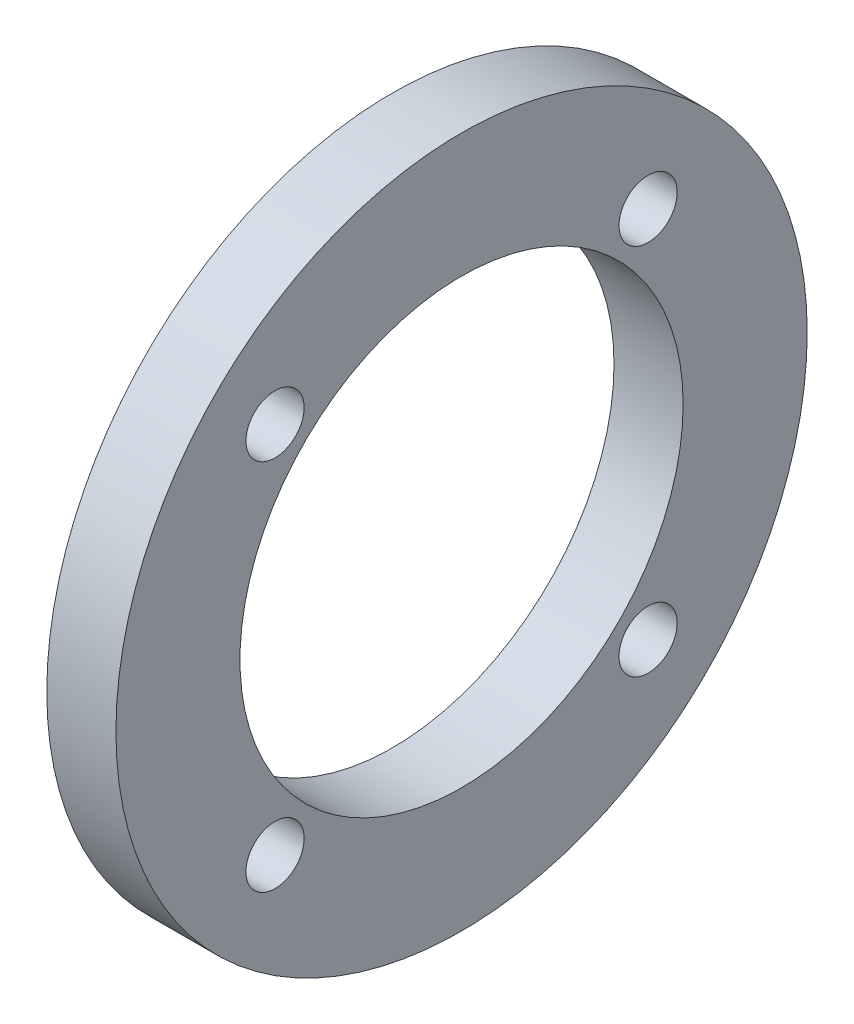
ISO-10303-21;
HEADER;
FILE_DESCRIPTION(('STEP AP214'),'2;1');
FILE_NAME('part.step','',(''),(''),'','','');
FILE_SCHEMA(('AUTOMOTIVE_DESIGN { 1 0 10303 214 1 1 1 1 }'));
ENDSEC;
DATA;
#1=APPLICATION_CONTEXT('core data for automotive mechanical design processes');
#2=APPLICATION_PROTOCOL_DEFINITION('international standard','automotive_design',2000,#1);
#3=PRODUCT_CONTEXT('',#1,'mechanical');
#4=PRODUCT('Part','Part','',(#3));
#5=PRODUCT_RELATED_PRODUCT_CATEGORY('part','',(#4));
#6=PRODUCT_DEFINITION_FORMATION('','',#4);
#7=PRODUCT_DEFINITION_CONTEXT('part definition',#1,'design');
#8=PRODUCT_DEFINITION('design','',#6,#7);
#9=PRODUCT_DEFINITION_SHAPE('','',#8);
#10=(LENGTH_UNIT() NAMED_UNIT(*) SI_UNIT(.MILLI.,.METRE.));
#11=(NAMED_UNIT(*) PLANE_ANGLE_UNIT() SI_UNIT($,.RADIAN.));
#12=(NAMED_UNIT(*) SI_UNIT($,.STERADIAN.) SOLID_ANGLE_UNIT());
#13=UNCERTAINTY_MEASURE_WITH_UNIT(LENGTH_MEASURE(1.E-05),#10,'distance_accuracy_value','');
#14=(GEOMETRIC_REPRESENTATION_CONTEXT(3) GLOBAL_UNCERTAINTY_ASSIGNED_CONTEXT((#13)) GLOBAL_UNIT_ASSIGNED_CONTEXT((#10,
#11,#12)) REPRESENTATION_CONTEXT('',''));
#15=CARTESIAN_POINT('',(0.,0.,0.));
#16=DIRECTION('',(0.,0.,1.));
#17=DIRECTION('',(1.,0.,0.));
#18=AXIS2_PLACEMENT_3D('',#15,#16,#17);
#19=CARTESIAN_POINT('',(0.,0.,0.));
#20=DIRECTION('',(1.,0.,0.));
#21=DIRECTION('',(0.,0.,-1.));
#22=AXIS2_PLACEMENT_3D('',#19,#20,#21);
#23=PLANE('',#22);
#24=CARTESIAN_POINT('',(0.,0.,0.));
#25=DIRECTION('',(1.,0.,0.));
#26=DIRECTION('',(0.,0.,-1.));
#27=AXIS2_PLACEMENT_3D('',#24,#25,#26);
#28=CIRCLE('',#27,60.9);
#29=CARTESIAN_POINT('',(0.,0.,-60.9));
#30=VERTEX_POINT('',#29);
#31=EDGE_CURVE('E41',#30,#30,#28,.T.);
#32=ORIENTED_EDGE('',*,*,#31,.T.);
#33=EDGE_LOOP('',(#32));
#34=FACE_BOUND('',#33,.T.);
#35=CARTESIAN_POINT('',(0.,-51.265241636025,51.265241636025));
#36=DIRECTION('',(1.,0.,0.));
#37=DIRECTION('',(0.,0.,-1.));
#38=AXIS2_PLACEMENT_3D('',#35,#36,#37);
#39=CIRCLE('',#38,8.);
#40=CARTESIAN_POINT('',(0.,-51.265241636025,43.265241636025));
#41=VERTEX_POINT('',#40);
#42=EDGE_CURVE('E44',#41,#41,#39,.T.);
#43=ORIENTED_EDGE('',*,*,#42,.T.);
#44=EDGE_LOOP('',(#43));
#45=FACE_BOUND('',#44,.T.);
#46=CARTESIAN_POINT('',(0.,51.265241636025,51.265241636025));
#47=DIRECTION('',(1.,0.,0.));
#48=DIRECTION('',(0.,0.,-1.));
#49=AXIS2_PLACEMENT_3D('',#46,#47,#48);
#50=CIRCLE('',#49,8.);
#51=CARTESIAN_POINT('',(0.,51.265241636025,43.265241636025));
#52=VERTEX_POINT('',#51);
#53=EDGE_CURVE('E47',#52,#52,#50,.T.);
#54=ORIENTED_EDGE('',*,*,#53,.T.);
#55=EDGE_LOOP('',(#54));
#56=FACE_BOUND('',#55,.T.);
#57=CARTESIAN_POINT('',(0.,-51.265241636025,-51.265241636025));
#58=DIRECTION('',(1.,0.,0.));
#59=DIRECTION('',(0.,0.,-1.));
#60=AXIS2_PLACEMENT_3D('',#57,#58,#59);
#61=CIRCLE('',#60,8.);
#62=CARTESIAN_POINT('',(0.,-51.265241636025,-59.265241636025));
#63=VERTEX_POINT('',#62);
#64=EDGE_CURVE('E50',#63,#63,#61,.T.);
#65=ORIENTED_EDGE('',*,*,#64,.T.);
#66=EDGE_LOOP('',(#65));
#67=FACE_BOUND('',#66,.T.);
#68=CARTESIAN_POINT('',(0.,51.265241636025,-51.265241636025));
#69=DIRECTION('',(1.,0.,0.));
#70=DIRECTION('',(0.,0.,-1.));
#71=AXIS2_PLACEMENT_3D('',#68,#69,#70);
#72=CIRCLE('',#71,8.);
#73=CARTESIAN_POINT('',(0.,51.265241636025,-59.265241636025));
#74=VERTEX_POINT('',#73);
#75=EDGE_CURVE('E52',#74,#74,#72,.T.);
#76=ORIENTED_EDGE('',*,*,#75,.T.);
#77=EDGE_LOOP('',(#76));
#78=FACE_BOUND('',#77,.T.);
#79=CARTESIAN_POINT('',(0.,0.,0.));
#80=DIRECTION('',(1.,0.,0.));
#81=DIRECTION('',(0.,0.,-1.));
#82=AXIS2_PLACEMENT_3D('',#79,#80,#81);
#83=CIRCLE('',#82,95.);
#84=CARTESIAN_POINT('',(0.,0.,-95.));
#85=VERTEX_POINT('',#84);
#86=EDGE_CURVE('E18',#85,#85,#83,.T.);
#87=ORIENTED_EDGE('',*,*,#86,.F.);
#88=EDGE_LOOP('',(#87));
#89=FACE_BOUND('',#88,.T.);
#90=ADVANCED_FACE('F15',(#34,#45,#56,#67,#78,#89),#23,.F.);
#91=CARTESIAN_POINT('',(0.,0.,0.));
#92=DIRECTION('',(1.,0.,0.));
#93=DIRECTION('',(0.,0.,-1.));
#94=AXIS2_PLACEMENT_3D('',#91,#92,#93);
#95=CYLINDRICAL_SURFACE('',#94,95.);
#96=CARTESIAN_POINT('',(19.,0.,0.));
#97=DIRECTION('',(1.,0.,0.));
#98=DIRECTION('',(0.,0.,-1.));
#99=AXIS2_PLACEMENT_3D('',#96,#97,#98);
#100=CIRCLE('',#99,95.);
#101=CARTESIAN_POINT('',(19.,0.,-95.));
#102=VERTEX_POINT('',#101);
#103=EDGE_CURVE('E38',#102,#102,#100,.T.);
#104=ORIENTED_EDGE('',*,*,#103,.F.);
#105=EDGE_LOOP('',(#104));
#106=FACE_BOUND('',#105,.T.);
#107=ORIENTED_EDGE('',*,*,#86,.T.);
#108=EDGE_LOOP('',(#107));
#109=FACE_BOUND('',#108,.T.);
#110=ADVANCED_FACE('F59',(#106,#109),#95,.T.);
#111=CARTESIAN_POINT('',(0.,51.265241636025,-51.265241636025));
#112=DIRECTION('',(1.,0.,0.));
#113=DIRECTION('',(0.,0.,-1.));
#114=AXIS2_PLACEMENT_3D('',#111,#112,#113);
#115=CYLINDRICAL_SURFACE('',#114,8.);
#116=CARTESIAN_POINT('',(19.,51.265241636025,-51.265241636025));
#117=DIRECTION('',(1.,0.,0.));
#118=DIRECTION('',(0.,0.,-1.));
#119=AXIS2_PLACEMENT_3D('',#116,#117,#118);
#120=CIRCLE('',#119,8.);
#121=CARTESIAN_POINT('',(19.,51.265241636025,-59.265241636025));
#122=VERTEX_POINT('',#121);
#123=EDGE_CURVE('E35',#122,#122,#120,.F.);
#124=ORIENTED_EDGE('',*,*,#123,.F.);
#125=EDGE_LOOP('',(#124));
#126=FACE_BOUND('',#125,.T.);
#127=ORIENTED_EDGE('',*,*,#75,.F.);
#128=EDGE_LOOP('',(#127));
#129=FACE_BOUND('',#128,.T.);
#130=ADVANCED_FACE('F67',(#126,#129),#115,.F.);
#131=CARTESIAN_POINT('',(0.,-51.265241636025,-51.265241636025));
#132=DIRECTION('',(1.,0.,0.));
#133=DIRECTION('',(0.,0.,-1.));
#134=AXIS2_PLACEMENT_3D('',#131,#132,#133);
#135=CYLINDRICAL_SURFACE('',#134,8.);
#136=CARTESIAN_POINT('',(19.,-51.265241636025,-51.265241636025));
#137=DIRECTION('',(1.,0.,0.));
#138=DIRECTION('',(0.,0.,-1.));
#139=AXIS2_PLACEMENT_3D('',#136,#137,#138);
#140=CIRCLE('',#139,8.);
#141=CARTESIAN_POINT('',(19.,-51.265241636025,-59.265241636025));
#142=VERTEX_POINT('',#141);
#143=EDGE_CURVE('E32',#142,#142,#140,.F.);
#144=ORIENTED_EDGE('',*,*,#143,.F.);
#145=EDGE_LOOP('',(#144));
#146=FACE_BOUND('',#145,.T.);
#147=ORIENTED_EDGE('',*,*,#64,.F.);
#148=EDGE_LOOP('',(#147));
#149=FACE_BOUND('',#148,.T.);
#150=ADVANCED_FACE('F88',(#146,#149),#135,.F.);
#151=CARTESIAN_POINT('',(0.,51.265241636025,51.265241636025));
#152=DIRECTION('',(1.,0.,0.));
#153=DIRECTION('',(0.,0.,-1.));
#154=AXIS2_PLACEMENT_3D('',#151,#152,#153);
#155=CYLINDRICAL_SURFACE('',#154,8.);
#156=CARTESIAN_POINT('',(19.,51.265241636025,51.265241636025));
#157=DIRECTION('',(1.,0.,0.));
#158=DIRECTION('',(0.,0.,-1.));
#159=AXIS2_PLACEMENT_3D('',#156,#157,#158);
#160=CIRCLE('',#159,8.);
#161=CARTESIAN_POINT('',(19.,51.265241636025,43.265241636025));
#162=VERTEX_POINT('',#161);
#163=EDGE_CURVE('E27',#162,#162,#160,.F.);
#164=ORIENTED_EDGE('',*,*,#163,.F.);
#165=EDGE_LOOP('',(#164));
#166=FACE_BOUND('',#165,.T.);
#167=ORIENTED_EDGE('',*,*,#53,.F.);
#168=EDGE_LOOP('',(#167));
#169=FACE_BOUND('',#168,.T.);
#170=ADVANCED_FACE('F84',(#166,#169),#155,.F.);
#171=CARTESIAN_POINT('',(0.,-51.265241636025,51.265241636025));
#172=DIRECTION('',(1.,0.,0.));
#173=DIRECTION('',(0.,0.,-1.));
#174=AXIS2_PLACEMENT_3D('',#171,#172,#173);
#175=CYLINDRICAL_SURFACE('',#174,8.);
#176=CARTESIAN_POINT('',(19.,-51.265241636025,51.265241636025));
#177=DIRECTION('',(1.,0.,0.));
#178=DIRECTION('',(0.,0.,-1.));
#179=AXIS2_PLACEMENT_3D('',#176,#177,#178);
#180=CIRCLE('',#179,8.);
#181=CARTESIAN_POINT('',(19.,-51.265241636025,43.265241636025));
#182=VERTEX_POINT('',#181);
#183=EDGE_CURVE('E22',#182,#182,#180,.F.);
#184=ORIENTED_EDGE('',*,*,#183,.F.);
#185=EDGE_LOOP('',(#184));
#186=FACE_BOUND('',#185,.T.);
#187=ORIENTED_EDGE('',*,*,#42,.F.);
#188=EDGE_LOOP('',(#187));
#189=FACE_BOUND('',#188,.T.);
#190=ADVANCED_FACE('F77',(#186,#189),#175,.F.);
#191=CARTESIAN_POINT('',(0.,0.,0.));
#192=DIRECTION('',(1.,0.,0.));
#193=DIRECTION('',(0.,0.,-1.));
#194=AXIS2_PLACEMENT_3D('',#191,#192,#193);
#195=CYLINDRICAL_SURFACE('',#194,60.9);
#196=CARTESIAN_POINT('',(19.,0.,0.));
#197=DIRECTION('',(1.,0.,0.));
#198=DIRECTION('',(0.,0.,-1.));
#199=AXIS2_PLACEMENT_3D('',#196,#197,#198);
#200=CIRCLE('',#199,60.9);
#201=CARTESIAN_POINT('',(19.,0.,-60.9));
#202=VERTEX_POINT('',#201);
#203=EDGE_CURVE('E10',#202,#202,#200,.F.);
#204=ORIENTED_EDGE('',*,*,#203,.F.);
#205=EDGE_LOOP('',(#204));
#206=FACE_BOUND('',#205,.T.);
#207=ORIENTED_EDGE('',*,*,#31,.F.);
#208=EDGE_LOOP('',(#207));
#209=FACE_BOUND('',#208,.T.);
#210=ADVANCED_FACE('F72',(#206,#209),#195,.F.);
#211=CARTESIAN_POINT('',(19.,0.,0.));
#212=DIRECTION('',(1.,0.,0.));
#213=DIRECTION('',(0.,0.,-1.));
#214=AXIS2_PLACEMENT_3D('',#211,#212,#213);
#215=PLANE('',#214);
#216=ORIENTED_EDGE('',*,*,#203,.T.);
#217=EDGE_LOOP('',(#216));
#218=FACE_BOUND('',#217,.T.);
#219=ORIENTED_EDGE('',*,*,#183,.T.);
#220=EDGE_LOOP('',(#219));
#221=FACE_BOUND('',#220,.T.);
#222=ORIENTED_EDGE('',*,*,#163,.T.);
#223=EDGE_LOOP('',(#222));
#224=FACE_BOUND('',#223,.T.);
#225=ORIENTED_EDGE('',*,*,#143,.T.);
#226=EDGE_LOOP('',(#225));
#227=FACE_BOUND('',#226,.T.);
#228=ORIENTED_EDGE('',*,*,#123,.T.);
#229=EDGE_LOOP('',(#228));
#230=FACE_BOUND('',#229,.T.);
#231=ORIENTED_EDGE('',*,*,#103,.T.);
#232=EDGE_LOOP('',(#231));
#233=FACE_BOUND('',#232,.T.);
#234=ADVANCED_FACE('F70',(#218,#221,#224,#227,#230,#233),#215,.T.);
#235=CLOSED_SHELL('',(#90,#110,#130,#150,#170,#190,#210,#234));
#236=MANIFOLD_SOLID_BREP('B1',#235);
#237=ADVANCED_BREP_SHAPE_REPRESENTATION('',(#18,#236),#14);
#238=SHAPE_DEFINITION_REPRESENTATION(#9,#237);
ENDSEC;
END-ISO-10303-21;
